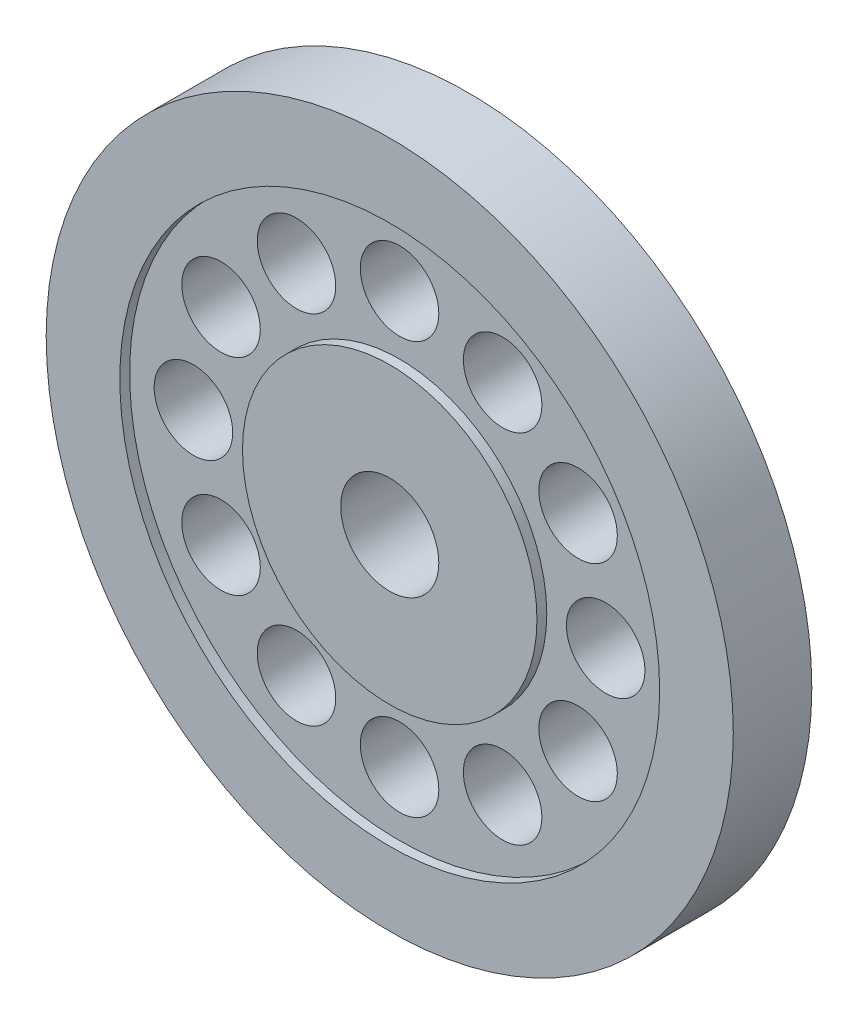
from build123d import *

# Parameters (mm, degrees)
ESQUISSE1_R                       = 35
BOSS_EXTRU_1_DEPTH                = 8
ESQUISSE2_R                       = 27.5
ESQUISSE2_R_2                     = 15
ENL_V_MAT_EXTRU_1_DEPTH           = 1
DIAM_TRE_DU_PER_AGE_0_15_0_15_1_D = 10
DIAM_TRE_DU_PER_AGE_0_15_0_15_2_D = 8
R_P_TITION_CIRCULAIRE1_COUNT      = 12


with BuildPart() as part:
    # Esquisse1 → Boss.-Extru.1 (new body)
    with BuildSketch(Plane.XY):
        Circle(ESQUISSE1_R)
    extrude(amount=BOSS_EXTRU_1_DEPTH)

    # Esquisse2 → Enl_v. mat.-Extru.1 (cut)
    with BuildSketch(Plane.XY.offset(8)):
        Circle(ESQUISSE2_R)
        Circle(ESQUISSE2_R_2, mode=Mode.SUBTRACT)
    extrude(amount=-ENL_V_MAT_EXTRU_1_DEPTH, mode=Mode.SUBTRACT)

    # Diam_tre du per_age _0.15 _0.15_1 (through all)
    with Locations(Plane.XY.offset(8)):
        with Locations((0, 0)):
            Hole(DIAM_TRE_DU_PER_AGE_0_15_0_15_1_D / 2)

    # Diam_tre du per_age _0.15 _0.15_2 (through all)
    with Locations(Plane.XY.offset(7)):
        with Locations((0, 21)):
            diam_tre_du_per_age_0_15_0_15_2 = Hole(DIAM_TRE_DU_PER_AGE_0_15_0_15_2_D / 2)

    # R_p_tition circulaire1: Diam_tre du per_age _0.15 _0.15_2 ×12 about axis
    r_p_tition_circulaire1_axis = Axis((0, 0, 0), (0, 0, 1))
    for i in range(1, R_P_TITION_CIRCULAIRE1_COUNT):
        add(diam_tre_du_per_age_0_15_0_15_2.rotate(r_p_tition_circulaire1_axis, i * 360 / R_P_TITION_CIRCULAIRE1_COUNT), mode=Mode.SUBTRACT)


solid = part.part
